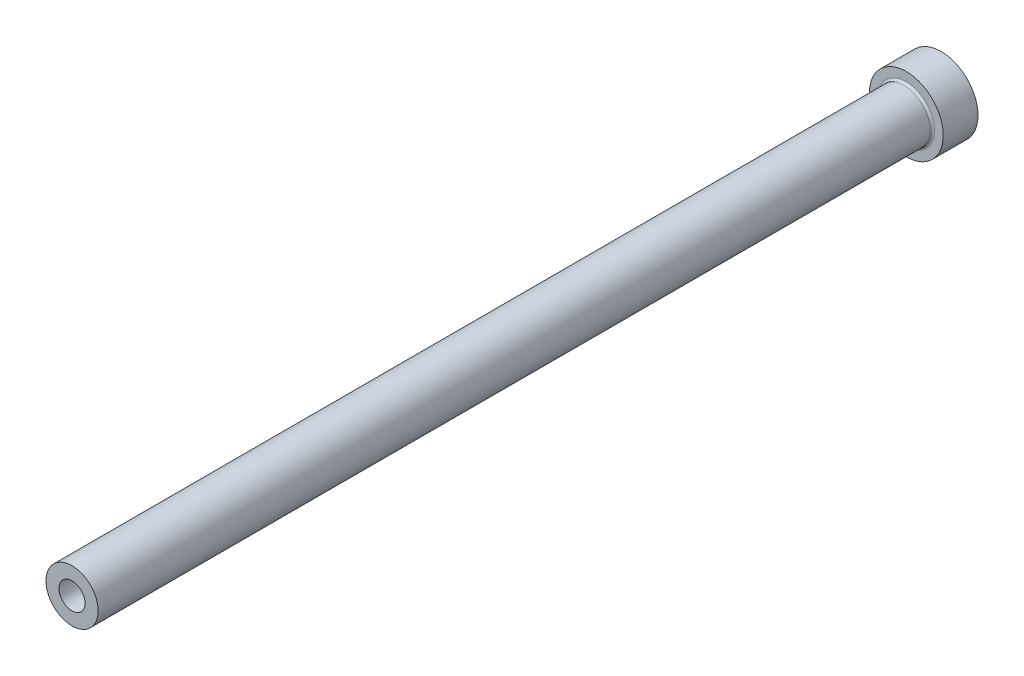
ISO-10303-21;
HEADER;
FILE_DESCRIPTION(('STEP AP214'),'2;1');
FILE_NAME('part.step','',(''),(''),'','','');
FILE_SCHEMA(('AUTOMOTIVE_DESIGN { 1 0 10303 214 1 1 1 1 }'));
ENDSEC;
DATA;
#1=APPLICATION_CONTEXT('core data for automotive mechanical design processes');
#2=APPLICATION_PROTOCOL_DEFINITION('international standard','automotive_design',2000,#1);
#3=PRODUCT_CONTEXT('',#1,'mechanical');
#4=PRODUCT('Part','Part','',(#3));
#5=PRODUCT_RELATED_PRODUCT_CATEGORY('part','',(#4));
#6=PRODUCT_DEFINITION_FORMATION('','',#4);
#7=PRODUCT_DEFINITION_CONTEXT('part definition',#1,'design');
#8=PRODUCT_DEFINITION('design','',#6,#7);
#9=PRODUCT_DEFINITION_SHAPE('','',#8);
#10=(LENGTH_UNIT() NAMED_UNIT(*) SI_UNIT(.MILLI.,.METRE.));
#11=(NAMED_UNIT(*) PLANE_ANGLE_UNIT() SI_UNIT($,.RADIAN.));
#12=(NAMED_UNIT(*) SI_UNIT($,.STERADIAN.) SOLID_ANGLE_UNIT());
#13=UNCERTAINTY_MEASURE_WITH_UNIT(LENGTH_MEASURE(1.E-05),#10,'distance_accuracy_value','');
#14=(GEOMETRIC_REPRESENTATION_CONTEXT(3) GLOBAL_UNCERTAINTY_ASSIGNED_CONTEXT((#13)) GLOBAL_UNIT_ASSIGNED_CONTEXT((#10,
#11,#12)) REPRESENTATION_CONTEXT('',''));
#15=CARTESIAN_POINT('',(0.,0.,0.));
#16=DIRECTION('',(0.,0.,1.));
#17=DIRECTION('',(1.,0.,0.));
#18=AXIS2_PLACEMENT_3D('',#15,#16,#17);
#19=CARTESIAN_POINT('',(0.,0.,200.));
#20=DIRECTION('',(0.,0.,-1.));
#21=DIRECTION('',(-1.,0.,0.));
#22=AXIS2_PLACEMENT_3D('',#19,#20,#21);
#23=PLANE('',#22);
#24=CARTESIAN_POINT('',(0.,0.,200.));
#25=DIRECTION('',(0.,0.,1.));
#26=DIRECTION('',(1.,0.,0.));
#27=AXIS2_PLACEMENT_3D('',#24,#25,#26);
#28=CIRCLE('',#27,2.99999999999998);
#29=CARTESIAN_POINT('',(2.99999999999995,0.,200.));
#30=VERTEX_POINT('',#29);
#31=EDGE_CURVE('E63',#30,#30,#28,.T.);
#32=ORIENTED_EDGE('',*,*,#31,.F.);
#33=EDGE_LOOP('',(#32));
#34=FACE_BOUND('',#33,.T.);
#35=CARTESIAN_POINT('',(0.,0.,200.));
#36=DIRECTION('',(0.,0.,1.));
#37=DIRECTION('',(1.,0.,0.));
#38=AXIS2_PLACEMENT_3D('',#35,#36,#37);
#39=CIRCLE('',#38,5.99999999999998);
#40=CARTESIAN_POINT('',(5.99999999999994,0.,200.));
#41=VERTEX_POINT('',#40);
#42=EDGE_CURVE('E54',#41,#41,#39,.T.);
#43=ORIENTED_EDGE('',*,*,#42,.T.);
#44=EDGE_LOOP('',(#43));
#45=FACE_BOUND('',#44,.T.);
#46=ADVANCED_FACE('F34',(#34,#45),#23,.F.);
#47=CARTESIAN_POINT('',(0.,0.,200.));
#48=DIRECTION('',(0.,0.,1.));
#49=DIRECTION('',(1.,0.,0.));
#50=AXIS2_PLACEMENT_3D('',#47,#48,#49);
#51=CYLINDRICAL_SURFACE('',#50,5.99999999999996);
#52=CARTESIAN_POINT('',(0.,0.,8.50000000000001));
#53=DIRECTION('',(0.,0.,1.));
#54=DIRECTION('',(1.,0.,0.));
#55=AXIS2_PLACEMENT_3D('',#52,#53,#54);
#56=CIRCLE('',#55,5.99999999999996);
#57=CARTESIAN_POINT('',(5.99999999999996,0.,8.50000000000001));
#58=VERTEX_POINT('',#57);
#59=EDGE_CURVE('E49',#58,#58,#56,.T.);
#60=ORIENTED_EDGE('',*,*,#59,.T.);
#61=EDGE_LOOP('',(#60));
#62=FACE_BOUND('',#61,.T.);
#63=ORIENTED_EDGE('',*,*,#42,.F.);
#64=EDGE_LOOP('',(#63));
#65=FACE_BOUND('',#64,.T.);
#66=ADVANCED_FACE('F92',(#62,#65),#51,.T.);
#67=CARTESIAN_POINT('',(0.,0.,7.99999999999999));
#68=DIRECTION('',(0.,0.,1.));
#69=DIRECTION('',(1.,0.,0.));
#70=AXIS2_PLACEMENT_3D('',#67,#68,#69);
#71=PLANE('',#70);
#72=CARTESIAN_POINT('',(0.,0.,7.99999999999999));
#73=DIRECTION('',(0.,0.,1.));
#74=DIRECTION('',(1.,0.,0.));
#75=AXIS2_PLACEMENT_3D('',#72,#73,#74);
#76=CIRCLE('',#75,6.49999999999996);
#77=CARTESIAN_POINT('',(6.49999999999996,0.,8.));
#78=VERTEX_POINT('',#77);
#79=EDGE_CURVE('E45',#78,#78,#76,.F.);
#80=ORIENTED_EDGE('',*,*,#79,.T.);
#81=EDGE_LOOP('',(#80));
#82=FACE_BOUND('',#81,.T.);
#83=CARTESIAN_POINT('',(0.,0.,8.00000000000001));
#84=DIRECTION('',(0.,0.,1.));
#85=DIRECTION('',(1.,0.,0.));
#86=AXIS2_PLACEMENT_3D('',#83,#84,#85);
#87=CIRCLE('',#86,8.49999999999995);
#88=CARTESIAN_POINT('',(8.49999999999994,0.,8.00000000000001));
#89=VERTEX_POINT('',#88);
#90=EDGE_CURVE('E57',#89,#89,#87,.T.);
#91=ORIENTED_EDGE('',*,*,#90,.T.);
#92=EDGE_LOOP('',(#91));
#93=FACE_BOUND('',#92,.T.);
#94=ADVANCED_FACE('F98',(#82,#93),#71,.T.);
#95=CARTESIAN_POINT('',(0.,0.,200.));
#96=DIRECTION('',(0.,0.,1.));
#97=DIRECTION('',(1.,0.,0.));
#98=AXIS2_PLACEMENT_3D('',#95,#96,#97);
#99=CYLINDRICAL_SURFACE('',#98,8.49999999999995);
#100=ORIENTED_EDGE('',*,*,#90,.F.);
#101=EDGE_LOOP('',(#100));
#102=FACE_BOUND('',#101,.T.);
#103=CARTESIAN_POINT('',(0.,0.,0.));
#104=DIRECTION('',(0.,0.,1.));
#105=DIRECTION('',(1.,0.,0.));
#106=AXIS2_PLACEMENT_3D('',#103,#104,#105);
#107=CIRCLE('',#106,8.49999999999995);
#108=CARTESIAN_POINT('',(8.49999999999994,0.,0.));
#109=VERTEX_POINT('',#108);
#110=EDGE_CURVE('E60',#109,#109,#107,.T.);
#111=ORIENTED_EDGE('',*,*,#110,.T.);
#112=EDGE_LOOP('',(#111));
#113=FACE_BOUND('',#112,.T.);
#114=ADVANCED_FACE('F89',(#102,#113),#99,.T.);
#115=CARTESIAN_POINT('',(0.,0.,0.));
#116=DIRECTION('',(0.,0.,1.));
#117=DIRECTION('',(1.,0.,0.));
#118=AXIS2_PLACEMENT_3D('',#115,#116,#117);
#119=PLANE('',#118);
#120=CARTESIAN_POINT('',(0.,0.,0.));
#121=DIRECTION('',(0.,0.,1.));
#122=DIRECTION('',(1.,0.,0.));
#123=AXIS2_PLACEMENT_3D('',#120,#121,#122);
#124=CIRCLE('',#123,3.74999999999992);
#125=CARTESIAN_POINT('',(3.74999999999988,0.,0.));
#126=VERTEX_POINT('',#125);
#127=EDGE_CURVE('E41',#126,#126,#124,.T.);
#128=ORIENTED_EDGE('',*,*,#127,.T.);
#129=EDGE_LOOP('',(#128));
#130=FACE_BOUND('',#129,.T.);
#131=ORIENTED_EDGE('',*,*,#110,.F.);
#132=EDGE_LOOP('',(#131));
#133=FACE_BOUND('',#132,.T.);
#134=ADVANCED_FACE('F83',(#130,#133),#119,.F.);
#135=CARTESIAN_POINT('',(0.,0.,200.));
#136=DIRECTION('',(0.,0.,1.));
#137=DIRECTION('',(1.,0.,0.));
#138=AXIS2_PLACEMENT_3D('',#135,#136,#137);
#139=CYLINDRICAL_SURFACE('',#138,2.99999999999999);
#140=ORIENTED_EDGE('',*,*,#31,.T.);
#141=EDGE_LOOP('',(#140));
#142=FACE_BOUND('',#141,.T.);
#143=CARTESIAN_POINT('',(0.,0.,125.));
#144=DIRECTION('',(0.,0.,1.));
#145=DIRECTION('',(1.,0.,0.));
#146=AXIS2_PLACEMENT_3D('',#143,#144,#145);
#147=CIRCLE('',#146,2.99999999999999);
#148=CARTESIAN_POINT('',(2.99999999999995,0.,125.));
#149=VERTEX_POINT('',#148);
#150=EDGE_CURVE('E66',#149,#149,#147,.T.);
#151=ORIENTED_EDGE('',*,*,#150,.F.);
#152=EDGE_LOOP('',(#151));
#153=FACE_BOUND('',#152,.T.);
#154=ADVANCED_FACE('F78',(#142,#153),#139,.F.);
#155=CARTESIAN_POINT('',(0.,0.,125.));
#156=DIRECTION('',(0.,0.,-1.));
#157=DIRECTION('',(-1.,0.,0.));
#158=AXIS2_PLACEMENT_3D('',#155,#156,#157);
#159=CONICAL_SURFACE('',#158,2.99999999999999,0.523598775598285);
#160=CARTESIAN_POINT('',(0.,0.,124.566987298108));
#161=DIRECTION('',(0.,0.,1.));
#162=DIRECTION('',(1.,0.,0.));
#163=AXIS2_PLACEMENT_3D('',#160,#161,#162);
#164=CIRCLE('',#163,3.24999999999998);
#165=CARTESIAN_POINT('',(3.24999999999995,0.,124.566987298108));
#166=VERTEX_POINT('',#165);
#167=EDGE_CURVE('E69',#166,#166,#164,.T.);
#168=ORIENTED_EDGE('',*,*,#167,.F.);
#169=EDGE_LOOP('',(#168));
#170=FACE_BOUND('',#169,.T.);
#171=ORIENTED_EDGE('',*,*,#150,.T.);
#172=EDGE_LOOP('',(#171));
#173=FACE_BOUND('',#172,.T.);
#174=ADVANCED_FACE('F75',(#170,#173),#159,.F.);
#175=CARTESIAN_POINT('',(0.,0.,200.));
#176=DIRECTION('',(0.,0.,1.));
#177=DIRECTION('',(1.,0.,0.));
#178=AXIS2_PLACEMENT_3D('',#175,#176,#177);
#179=CYLINDRICAL_SURFACE('',#178,3.24999999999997);
#180=CARTESIAN_POINT('',(0.,0.,0.499999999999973));
#181=DIRECTION('',(0.,0.,1.));
#182=DIRECTION('',(1.,0.,0.));
#183=AXIS2_PLACEMENT_3D('',#180,#181,#182);
#184=CIRCLE('',#183,3.24999999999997);
#185=CARTESIAN_POINT('',(3.24999999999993,0.,0.499999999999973));
#186=VERTEX_POINT('',#185);
#187=EDGE_CURVE('E10',#186,#186,#184,.F.);
#188=ORIENTED_EDGE('',*,*,#187,.T.);
#189=EDGE_LOOP('',(#188));
#190=FACE_BOUND('',#189,.T.);
#191=ORIENTED_EDGE('',*,*,#167,.T.);
#192=EDGE_LOOP('',(#191));
#193=FACE_BOUND('',#192,.T.);
#194=ADVANCED_FACE('F73',(#190,#193),#179,.F.);
#195=CARTESIAN_POINT('',(0.,0.,8.50000000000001));
#196=DIRECTION('',(0.,0.,1.));
#197=DIRECTION('',(1.,0.,0.));
#198=AXIS2_PLACEMENT_3D('',#195,#196,#197);
#199=TOROIDAL_SURFACE('',#198,6.49999999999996,0.5);
#200=ORIENTED_EDGE('',*,*,#79,.F.);
#201=EDGE_LOOP('',(#200));
#202=FACE_BOUND('',#201,.T.);
#203=ORIENTED_EDGE('',*,*,#59,.F.);
#204=EDGE_LOOP('',(#203));
#205=FACE_BOUND('',#204,.T.);
#206=ADVANCED_FACE('F104',(#202,#205),#199,.F.);
#207=CARTESIAN_POINT('',(0.,0.,0.));
#208=DIRECTION('',(0.,0.,-1.));
#209=DIRECTION('',(-1.,0.,0.));
#210=AXIS2_PLACEMENT_3D('',#207,#208,#209);
#211=CONICAL_SURFACE('',#210,3.74999999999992,0.785398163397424);
#212=ORIENTED_EDGE('',*,*,#187,.F.);
#213=EDGE_LOOP('',(#212));
#214=FACE_BOUND('',#213,.T.);
#215=ORIENTED_EDGE('',*,*,#127,.F.);
#216=EDGE_LOOP('',(#215));
#217=FACE_BOUND('',#216,.T.);
#218=ADVANCED_FACE('F36',(#214,#217),#211,.F.);
#219=CLOSED_SHELL('',(#46,#66,#94,#114,#134,#154,#174,#194,#206,#218));
#220=MANIFOLD_SOLID_BREP('B2',#219);
#221=ADVANCED_BREP_SHAPE_REPRESENTATION('',(#18,#220),#14);
#222=SHAPE_DEFINITION_REPRESENTATION(#9,#221);
ENDSEC;
END-ISO-10303-21;
